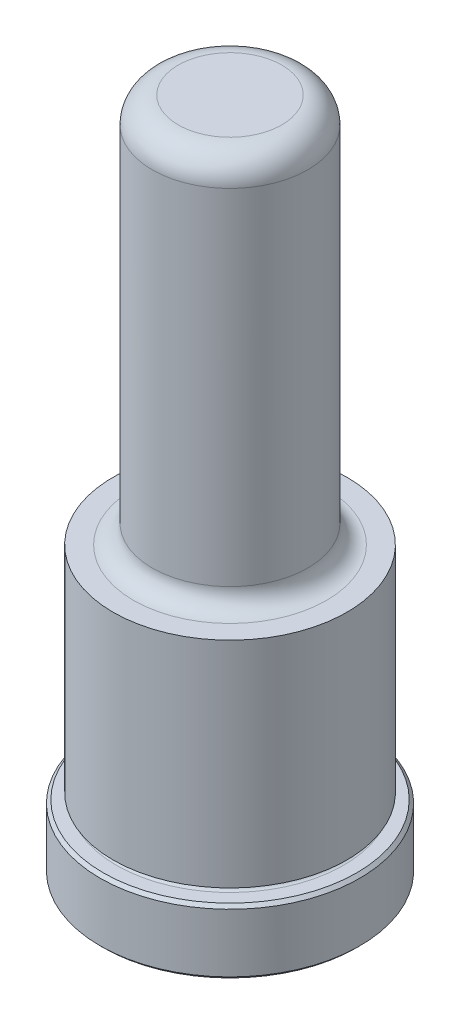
from build123d import *

# Parameters (mm, degrees)
CHAMFER1_SIZE = 0.381
FILLET1_R     = 3.175


with BuildPart() as part:
    # Sketch1 → Revolve1 (revolve)
    with BuildSketch(Plane(origin=(0, 0, 0), x_dir=(0, 0, -1), z_dir=(1, 0, 0)), mode=Mode.PRIVATE) as revolve1_sk:
        with BuildLine():
            Line((0, 0), (15.875, 0))
            Line((15.875, 0), (15.875, 7.9248))
            Line((15.875, 7.9248), (13.8938, 7.9248))
            ThreePointArc((13.8938, 7.9248), (13.5128, 8.3058), (13.8938, 8.6868))
            Line((13.8938, 8.6868), (14.3002, 8.6868))
            Line((14.3002, 8.6868), (14.3002, 34.925))
            Line((14.3002, 34.925), (11.7983, 34.925))
            ThreePointArc((11.7983, 34.925), (10.181853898, 35.594553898), (9.5123, 37.211))
            Line((9.5123, 37.211), (9.5123, 82.55))
            Line((9.5123, 82.55), (0, 82.55))
            Line((0, 82.55), (0, 0))
        make_face()
    revolve(revolve1_sk.sketch.rotate(Axis((0, 0, 0), (0, -1, 0)), 180), axis=Axis((0, 0, 0), (0, -1, 0)))

    # Chamfer1
    chamfer1_edges = [part.edges().sort_by_distance(p)[0] for p in [
        (0, 7.9248, -15.875),
        (0, 0, -15.875),
    ]]
    chamfer(chamfer1_edges, length=CHAMFER1_SIZE)

    # Fillet1
    fillet1_edges = [part.edges().sort_by_distance(p)[0] for p in [
        (0, 82.55, -9.5123),
    ]]
    fillet(fillet1_edges, radius=FILLET1_R)


solid = part.part
